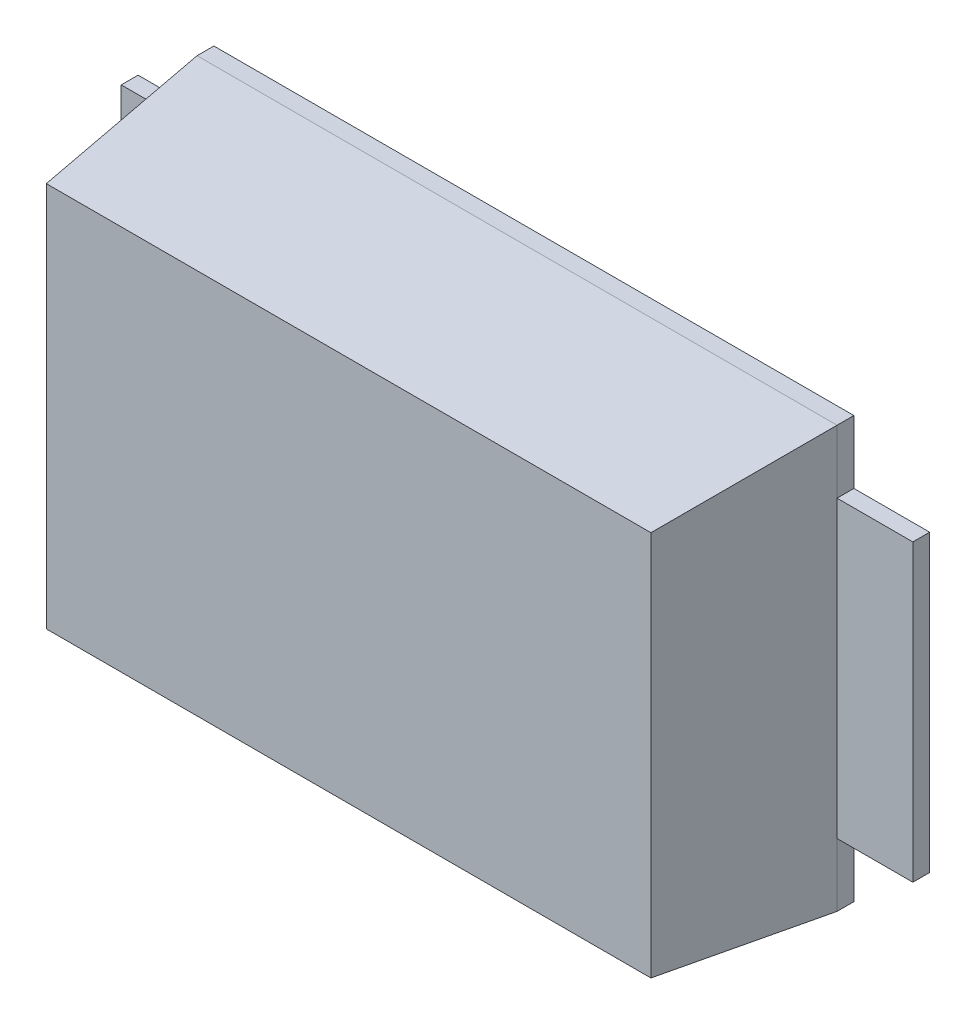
ISO-10303-21;
HEADER;
FILE_DESCRIPTION(('STEP AP214'),'2;1');
FILE_NAME('part.step','',(''),(''),'','','');
FILE_SCHEMA(('AUTOMOTIVE_DESIGN { 1 0 10303 214 1 1 1 1 }'));
ENDSEC;
DATA;
#1=APPLICATION_CONTEXT('core data for automotive mechanical design processes');
#2=APPLICATION_PROTOCOL_DEFINITION('international standard','automotive_design',2000,#1);
#3=PRODUCT_CONTEXT('',#1,'mechanical');
#4=PRODUCT('Part','Part','',(#3));
#5=PRODUCT_RELATED_PRODUCT_CATEGORY('part','',(#4));
#6=PRODUCT_DEFINITION_FORMATION('','',#4);
#7=PRODUCT_DEFINITION_CONTEXT('part definition',#1,'design');
#8=PRODUCT_DEFINITION('design','',#6,#7);
#9=PRODUCT_DEFINITION_SHAPE('','',#8);
#10=(LENGTH_UNIT() NAMED_UNIT(*) SI_UNIT(.MILLI.,.METRE.));
#11=(NAMED_UNIT(*) PLANE_ANGLE_UNIT() SI_UNIT($,.RADIAN.));
#12=(NAMED_UNIT(*) SI_UNIT($,.STERADIAN.) SOLID_ANGLE_UNIT());
#13=UNCERTAINTY_MEASURE_WITH_UNIT(LENGTH_MEASURE(1.E-05),#10,'distance_accuracy_value','');
#14=(GEOMETRIC_REPRESENTATION_CONTEXT(3) GLOBAL_UNCERTAINTY_ASSIGNED_CONTEXT((#13)) GLOBAL_UNIT_ASSIGNED_CONTEXT((#10,
#11,#12)) REPRESENTATION_CONTEXT('',''));
#15=CARTESIAN_POINT('',(0.,0.,0.));
#16=DIRECTION('',(0.,0.,1.));
#17=DIRECTION('',(1.,0.,0.));
#18=AXIS2_PLACEMENT_3D('',#15,#16,#17);
#19=CARTESIAN_POINT('',(0.,0.,1.1));
#20=DIRECTION('',(0.,0.,1.));
#21=DIRECTION('',(1.,0.,0.));
#22=AXIS2_PLACEMENT_3D('',#19,#20,#21);
#23=PLANE('',#22);
#24=DIRECTION('',(1.,0.,0.));
#25=VECTOR('',#24,1.);
#26=CARTESIAN_POINT('',(-0.95,1.144895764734,1.1));
#27=LINE('',#26,#25);
#28=CARTESIAN_POINT('',(-1.794895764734,1.144895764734,1.1));
#29=VERTEX_POINT('',#28);
#30=CARTESIAN_POINT('',(1.794895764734,1.144895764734,1.1));
#31=VERTEX_POINT('',#30);
#32=EDGE_CURVE('E43',#29,#31,#27,.T.);
#33=ORIENTED_EDGE('',*,*,#32,.F.);
#34=DIRECTION('',(0.,1.,0.));
#35=VECTOR('',#34,1.);
#36=CARTESIAN_POINT('',(-1.794895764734,-0.625,1.1));
#37=LINE('',#36,#35);
#38=CARTESIAN_POINT('',(-1.794895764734,-1.144895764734,1.1));
#39=VERTEX_POINT('',#38);
#40=EDGE_CURVE('E293',#39,#29,#37,.T.);
#41=ORIENTED_EDGE('',*,*,#40,.F.);
#42=DIRECTION('',(-1.,0.,0.));
#43=VECTOR('',#42,1.);
#44=CARTESIAN_POINT('',(0.95,-1.144895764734,1.1));
#45=LINE('',#44,#43);
#46=CARTESIAN_POINT('',(1.794895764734,-1.144895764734,1.1));
#47=VERTEX_POINT('',#46);
#48=EDGE_CURVE('E247',#47,#39,#45,.T.);
#49=ORIENTED_EDGE('',*,*,#48,.F.);
#50=DIRECTION('',(0.,-1.,0.));
#51=VECTOR('',#50,1.);
#52=CARTESIAN_POINT('',(1.794895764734,0.625,1.1));
#53=LINE('',#52,#51);
#54=EDGE_CURVE('E11',#31,#47,#53,.T.);
#55=ORIENTED_EDGE('',*,*,#54,.F.);
#56=EDGE_LOOP('',(#33,#41,#49,#55));
#57=FACE_BOUND('',#56,.T.);
#58=ADVANCED_FACE('F17',(#57),#23,.T.);
#59=CARTESIAN_POINT('',(1.9,1.25,0.1));
#60=DIRECTION('',(0.994521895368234,0.,0.104528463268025));
#61=DIRECTION('',(0.,-1.,0.));
#62=AXIS2_PLACEMENT_3D('',#59,#60,#61);
#63=PLANE('',#62);
#64=ORIENTED_EDGE('',*,*,#54,.T.);
#65=DIRECTION('',(-0.103962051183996,0.103962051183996,0.989132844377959));
#66=VECTOR('',#65,1.);
#67=CARTESIAN_POINT('',(1.886489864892,-1.236489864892,0.228540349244));
#68=LINE('',#67,#66);
#69=CARTESIAN_POINT('',(1.9,-1.25,0.1));
#70=VERTEX_POINT('',#69);
#71=EDGE_CURVE('E286',#70,#47,#68,.T.);
#72=ORIENTED_EDGE('',*,*,#71,.F.);
#73=DIRECTION('',(0.,1.,0.));
#74=VECTOR('',#73,1.);
#75=CARTESIAN_POINT('',(1.9,-1.25,0.1));
#76=LINE('',#75,#74);
#77=CARTESIAN_POINT('',(1.9,-0.875,0.1));
#78=VERTEX_POINT('',#77);
#79=EDGE_CURVE('E572',#70,#78,#76,.T.);
#80=ORIENTED_EDGE('',*,*,#79,.T.);
#81=DIRECTION('',(0.,1.,0.));
#82=VECTOR('',#81,1.);
#83=CARTESIAN_POINT('',(1.9,-1.25,0.1));
#84=LINE('',#83,#82);
#85=CARTESIAN_POINT('',(1.9,0.875,0.1));
#86=VERTEX_POINT('',#85);
#87=EDGE_CURVE('E189',#78,#86,#84,.T.);
#88=ORIENTED_EDGE('',*,*,#87,.T.);
#89=DIRECTION('',(0.,1.,0.));
#90=VECTOR('',#89,1.);
#91=CARTESIAN_POINT('',(1.9,-1.25,0.1));
#92=LINE('',#91,#90);
#93=CARTESIAN_POINT('',(1.9,1.25,0.1));
#94=VERTEX_POINT('',#93);
#95=EDGE_CURVE('E186',#86,#94,#92,.T.);
#96=ORIENTED_EDGE('',*,*,#95,.T.);
#97=DIRECTION('',(-0.103962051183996,-0.103962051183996,0.989132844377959));
#98=VECTOR('',#97,1.);
#99=CARTESIAN_POINT('',(1.879464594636,1.229464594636,0.295381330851));
#100=LINE('',#99,#98);
#101=EDGE_CURVE('E20',#94,#31,#100,.T.);
#102=ORIENTED_EDGE('',*,*,#101,.T.);
#103=EDGE_LOOP('',(#64,#72,#80,#88,#96,#102));
#104=FACE_BOUND('',#103,.T.);
#105=ADVANCED_FACE('F187',(#104),#63,.T.);
#106=CARTESIAN_POINT('',(-1.9,1.25,0.1));
#107=DIRECTION('',(0.,0.994521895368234,0.104528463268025));
#108=DIRECTION('',(1.,0.,0.));
#109=AXIS2_PLACEMENT_3D('',#106,#107,#108);
#110=PLANE('',#109);
#111=ORIENTED_EDGE('',*,*,#32,.T.);
#112=ORIENTED_EDGE('',*,*,#101,.F.);
#113=DIRECTION('',(-1.,0.,0.));
#114=VECTOR('',#113,1.);
#115=CARTESIAN_POINT('',(1.9,1.25,0.1));
#116=LINE('',#115,#114);
#117=CARTESIAN_POINT('',(-1.9,1.25,0.1));
#118=VERTEX_POINT('',#117);
#119=EDGE_CURVE('E167',#94,#118,#116,.T.);
#120=ORIENTED_EDGE('',*,*,#119,.T.);
#121=DIRECTION('',(0.103962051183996,-0.103962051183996,0.989132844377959));
#122=VECTOR('',#121,1.);
#123=CARTESIAN_POINT('',(-1.886489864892,1.236489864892,0.228540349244));
#124=LINE('',#123,#122);
#125=EDGE_CURVE('E294',#118,#29,#124,.T.);
#126=ORIENTED_EDGE('',*,*,#125,.T.);
#127=EDGE_LOOP('',(#111,#112,#120,#126));
#128=FACE_BOUND('',#127,.T.);
#129=ADVANCED_FACE('F166',(#128),#110,.T.);
#130=CARTESIAN_POINT('',(-1.9,-1.25,0.1));
#131=DIRECTION('',(-0.994521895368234,0.,0.104528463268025));
#132=DIRECTION('',(0.,1.,0.));
#133=AXIS2_PLACEMENT_3D('',#130,#131,#132);
#134=PLANE('',#133);
#135=ORIENTED_EDGE('',*,*,#40,.T.);
#136=ORIENTED_EDGE('',*,*,#125,.F.);
#137=DIRECTION('',(0.,-1.,0.));
#138=VECTOR('',#137,1.);
#139=CARTESIAN_POINT('',(-1.9,1.25,0.1));
#140=LINE('',#139,#138);
#141=CARTESIAN_POINT('',(-1.9,0.875,0.1));
#142=VERTEX_POINT('',#141);
#143=EDGE_CURVE('E266',#118,#142,#140,.T.);
#144=ORIENTED_EDGE('',*,*,#143,.T.);
#145=DIRECTION('',(0.,-1.,0.));
#146=VECTOR('',#145,1.);
#147=CARTESIAN_POINT('',(-1.9,1.25,0.1));
#148=LINE('',#147,#146);
#149=CARTESIAN_POINT('',(-1.9,-0.875,0.1));
#150=VERTEX_POINT('',#149);
#151=EDGE_CURVE('E262',#142,#150,#148,.T.);
#152=ORIENTED_EDGE('',*,*,#151,.T.);
#153=DIRECTION('',(0.,-1.,0.));
#154=VECTOR('',#153,1.);
#155=CARTESIAN_POINT('',(-1.9,1.25,0.1));
#156=LINE('',#155,#154);
#157=CARTESIAN_POINT('',(-1.9,-1.25,0.1));
#158=VERTEX_POINT('',#157);
#159=EDGE_CURVE('E276',#150,#158,#156,.T.);
#160=ORIENTED_EDGE('',*,*,#159,.T.);
#161=DIRECTION('',(0.103962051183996,0.103962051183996,0.989132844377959));
#162=VECTOR('',#161,1.);
#163=CARTESIAN_POINT('',(-1.879464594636,-1.229464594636,0.295381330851));
#164=LINE('',#163,#162);
#165=EDGE_CURVE('E251',#158,#39,#164,.T.);
#166=ORIENTED_EDGE('',*,*,#165,.T.);
#167=EDGE_LOOP('',(#135,#136,#144,#152,#160,#166));
#168=FACE_BOUND('',#167,.T.);
#169=ADVANCED_FACE('F333',(#168),#134,.T.);
#170=CARTESIAN_POINT('',(1.9,-1.25,0.1));
#171=DIRECTION('',(0.,-0.994521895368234,0.104528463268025));
#172=DIRECTION('',(-1.,0.,0.));
#173=AXIS2_PLACEMENT_3D('',#170,#171,#172);
#174=PLANE('',#173);
#175=ORIENTED_EDGE('',*,*,#48,.T.);
#176=ORIENTED_EDGE('',*,*,#165,.F.);
#177=DIRECTION('',(1.,0.,0.));
#178=VECTOR('',#177,1.);
#179=CARTESIAN_POINT('',(-1.9,-1.25,0.1));
#180=LINE('',#179,#178);
#181=EDGE_CURVE('E252',#158,#70,#180,.T.);
#182=ORIENTED_EDGE('',*,*,#181,.T.);
#183=ORIENTED_EDGE('',*,*,#71,.T.);
#184=EDGE_LOOP('',(#175,#176,#182,#183));
#185=FACE_BOUND('',#184,.T.);
#186=ADVANCED_FACE('F337',(#185),#174,.T.);
#187=CARTESIAN_POINT('',(0.,0.,0.0001));
#188=DIRECTION('',(0.,0.,1.));
#189=DIRECTION('',(1.,0.,0.));
#190=AXIS2_PLACEMENT_3D('',#187,#188,#189);
#191=PLANE('',#190);
#192=DIRECTION('',(1.,0.,0.));
#193=VECTOR('',#192,1.);
#194=CARTESIAN_POINT('',(0.,1.25,0.0001));
#195=LINE('',#194,#193);
#196=CARTESIAN_POINT('',(-1.9,1.25,0.0001));
#197=VERTEX_POINT('',#196);
#198=CARTESIAN_POINT('',(1.9,1.25,0.0001));
#199=VERTEX_POINT('',#198);
#200=EDGE_CURVE('E183',#197,#199,#195,.T.);
#201=ORIENTED_EDGE('',*,*,#200,.T.);
#202=DIRECTION('',(0.,-1.,0.));
#203=VECTOR('',#202,1.);
#204=CARTESIAN_POINT('',(1.9,0.,0.0001));
#205=LINE('',#204,#203);
#206=CARTESIAN_POINT('',(1.9,0.875,0.0001));
#207=VERTEX_POINT('',#206);
#208=EDGE_CURVE('E197',#199,#207,#205,.T.);
#209=ORIENTED_EDGE('',*,*,#208,.T.);
#210=DIRECTION('',(0.,-1.,0.));
#211=VECTOR('',#210,1.);
#212=CARTESIAN_POINT('',(1.9,0.,0.0001));
#213=LINE('',#212,#211);
#214=CARTESIAN_POINT('',(1.9,-0.875,0.0001));
#215=VERTEX_POINT('',#214);
#216=EDGE_CURVE('E617',#207,#215,#213,.T.);
#217=ORIENTED_EDGE('',*,*,#216,.T.);
#218=DIRECTION('',(0.,-1.,0.));
#219=VECTOR('',#218,1.);
#220=CARTESIAN_POINT('',(1.9,0.,0.0001));
#221=LINE('',#220,#219);
#222=CARTESIAN_POINT('',(1.9,-1.25,0.0001));
#223=VERTEX_POINT('',#222);
#224=EDGE_CURVE('E202',#215,#223,#221,.T.);
#225=ORIENTED_EDGE('',*,*,#224,.T.);
#226=DIRECTION('',(-1.,0.,0.));
#227=VECTOR('',#226,1.);
#228=CARTESIAN_POINT('',(0.,-1.25,0.0001));
#229=LINE('',#228,#227);
#230=CARTESIAN_POINT('',(-1.9,-1.25,0.0001));
#231=VERTEX_POINT('',#230);
#232=EDGE_CURVE('E182',#223,#231,#229,.T.);
#233=ORIENTED_EDGE('',*,*,#232,.T.);
#234=DIRECTION('',(0.,1.,0.));
#235=VECTOR('',#234,1.);
#236=CARTESIAN_POINT('',(-1.9,0.,0.0001));
#237=LINE('',#236,#235);
#238=CARTESIAN_POINT('',(-1.9,-0.875,0.0001));
#239=VERTEX_POINT('',#238);
#240=EDGE_CURVE('E275',#231,#239,#237,.T.);
#241=ORIENTED_EDGE('',*,*,#240,.T.);
#242=DIRECTION('',(0.,1.,0.));
#243=VECTOR('',#242,1.);
#244=CARTESIAN_POINT('',(-1.9,0.,0.0001));
#245=LINE('',#244,#243);
#246=CARTESIAN_POINT('',(-1.9,0.875,0.0001));
#247=VERTEX_POINT('',#246);
#248=EDGE_CURVE('E222',#239,#247,#245,.T.);
#249=ORIENTED_EDGE('',*,*,#248,.T.);
#250=DIRECTION('',(0.,1.,0.));
#251=VECTOR('',#250,1.);
#252=CARTESIAN_POINT('',(-1.9,0.,0.0001));
#253=LINE('',#252,#251);
#254=EDGE_CURVE('E271',#247,#197,#253,.T.);
#255=ORIENTED_EDGE('',*,*,#254,.T.);
#256=EDGE_LOOP('',(#201,#209,#217,#225,#233,#241,#249,#255));
#257=FACE_BOUND('',#256,.T.);
#258=ADVANCED_FACE('F450',(#257),#191,.F.);
#259=CARTESIAN_POINT('',(0.,-1.25,0.1));
#260=DIRECTION('',(0.,-1.,0.));
#261=DIRECTION('',(0.,0.,-1.));
#262=AXIS2_PLACEMENT_3D('',#259,#260,#261);
#263=PLANE('',#262);
#264=ORIENTED_EDGE('',*,*,#232,.F.);
#265=DIRECTION('',(0.,0.,-1.));
#266=VECTOR('',#265,1.);
#267=CARTESIAN_POINT('',(1.9,-1.25,0.1));
#268=LINE('',#267,#266);
#269=EDGE_CURVE('E575',#70,#223,#268,.T.);
#270=ORIENTED_EDGE('',*,*,#269,.F.);
#271=ORIENTED_EDGE('',*,*,#181,.F.);
#272=DIRECTION('',(0.,0.,-1.));
#273=VECTOR('',#272,1.);
#274=CARTESIAN_POINT('',(-1.9,-1.25,0.1));
#275=LINE('',#274,#273);
#276=EDGE_CURVE('E280',#158,#231,#275,.T.);
#277=ORIENTED_EDGE('',*,*,#276,.T.);
#278=EDGE_LOOP('',(#264,#270,#271,#277));
#279=FACE_BOUND('',#278,.T.);
#280=ADVANCED_FACE('F443',(#279),#263,.T.);
#281=CARTESIAN_POINT('',(0.,1.25,0.1));
#282=DIRECTION('',(0.,1.,0.));
#283=DIRECTION('',(1.,0.,0.));
#284=AXIS2_PLACEMENT_3D('',#281,#282,#283);
#285=PLANE('',#284);
#286=ORIENTED_EDGE('',*,*,#200,.F.);
#287=DIRECTION('',(0.,0.,-1.));
#288=VECTOR('',#287,1.);
#289=CARTESIAN_POINT('',(-1.9,1.25,0.1));
#290=LINE('',#289,#288);
#291=EDGE_CURVE('E179',#118,#197,#290,.T.);
#292=ORIENTED_EDGE('',*,*,#291,.F.);
#293=ORIENTED_EDGE('',*,*,#119,.F.);
#294=DIRECTION('',(0.,0.,-1.));
#295=VECTOR('',#294,1.);
#296=CARTESIAN_POINT('',(1.9,1.25,0.1));
#297=LINE('',#296,#295);
#298=EDGE_CURVE('E176',#94,#199,#297,.T.);
#299=ORIENTED_EDGE('',*,*,#298,.T.);
#300=EDGE_LOOP('',(#286,#292,#293,#299));
#301=FACE_BOUND('',#300,.T.);
#302=ADVANCED_FACE('F174',(#301),#285,.T.);
#303=CARTESIAN_POINT('',(-1.9,0.,0.1));
#304=DIRECTION('',(-1.,0.,0.));
#305=DIRECTION('',(0.,0.,1.));
#306=AXIS2_PLACEMENT_3D('',#303,#304,#305);
#307=PLANE('',#306);
#308=DIRECTION('',(0.,0.,-1.));
#309=VECTOR('',#308,1.);
#310=CARTESIAN_POINT('',(-1.9,-0.875,0.05));
#311=LINE('',#310,#309);
#312=EDGE_CURVE('E246',#150,#239,#311,.T.);
#313=ORIENTED_EDGE('',*,*,#312,.T.);
#314=ORIENTED_EDGE('',*,*,#240,.F.);
#315=ORIENTED_EDGE('',*,*,#276,.F.);
#316=ORIENTED_EDGE('',*,*,#159,.F.);
#317=EDGE_LOOP('',(#313,#314,#315,#316));
#318=FACE_BOUND('',#317,.T.);
#319=ADVANCED_FACE('F428',(#318),#307,.T.);
#320=CARTESIAN_POINT('',(-1.9,0.,0.1));
#321=DIRECTION('',(-1.,0.,0.));
#322=DIRECTION('',(0.,0.,1.));
#323=AXIS2_PLACEMENT_3D('',#320,#321,#322);
#324=PLANE('',#323);
#325=DIRECTION('',(0.,0.,1.));
#326=VECTOR('',#325,1.);
#327=CARTESIAN_POINT('',(-1.9,0.875,0.05));
#328=LINE('',#327,#326);
#329=EDGE_CURVE('E209',#247,#142,#328,.T.);
#330=ORIENTED_EDGE('',*,*,#329,.T.);
#331=ORIENTED_EDGE('',*,*,#143,.F.);
#332=ORIENTED_EDGE('',*,*,#291,.T.);
#333=ORIENTED_EDGE('',*,*,#254,.F.);
#334=EDGE_LOOP('',(#330,#331,#332,#333));
#335=FACE_BOUND('',#334,.T.);
#336=ADVANCED_FACE('F309',(#335),#324,.T.);
#337=CARTESIAN_POINT('',(0.,0.,0.1));
#338=DIRECTION('',(0.,0.,1.));
#339=DIRECTION('',(1.,0.,0.));
#340=AXIS2_PLACEMENT_3D('',#337,#338,#339);
#341=PLANE('',#340);
#342=DIRECTION('',(-1.,0.,0.));
#343=VECTOR('',#342,1.);
#344=CARTESIAN_POINT('',(-1.0625,-0.875,0.1));
#345=LINE('',#344,#343);
#346=CARTESIAN_POINT('',(-2.35,-0.875,0.1));
#347=VERTEX_POINT('',#346);
#348=EDGE_CURVE('E234',#150,#347,#345,.T.);
#349=ORIENTED_EDGE('',*,*,#348,.F.);
#350=ORIENTED_EDGE('',*,*,#151,.F.);
#351=DIRECTION('',(1.,0.,0.));
#352=VECTOR('',#351,1.);
#353=CARTESIAN_POINT('',(-1.0625,0.875,0.1));
#354=LINE('',#353,#352);
#355=CARTESIAN_POINT('',(-2.35,0.875,0.1));
#356=VERTEX_POINT('',#355);
#357=EDGE_CURVE('E194',#356,#142,#354,.T.);
#358=ORIENTED_EDGE('',*,*,#357,.F.);
#359=DIRECTION('',(0.,1.,0.));
#360=VECTOR('',#359,1.);
#361=CARTESIAN_POINT('',(-2.35,0.,0.1));
#362=LINE('',#361,#360);
#363=EDGE_CURVE('E256',#347,#356,#362,.T.);
#364=ORIENTED_EDGE('',*,*,#363,.F.);
#365=EDGE_LOOP('',(#349,#350,#358,#364));
#366=FACE_BOUND('',#365,.T.);
#367=ADVANCED_FACE('F303',(#366),#341,.T.);
#368=CARTESIAN_POINT('',(-2.125,0.,0.));
#369=DIRECTION('',(0.,0.,1.));
#370=DIRECTION('',(1.,0.,0.));
#371=AXIS2_PLACEMENT_3D('',#368,#369,#370);
#372=PLANE('',#371);
#373=DIRECTION('',(0.,-1.,0.));
#374=VECTOR('',#373,1.);
#375=CARTESIAN_POINT('',(-1.9,0.875,0.));
#376=LINE('',#375,#374);
#377=CARTESIAN_POINT('',(-1.9,0.875,0.));
#378=VERTEX_POINT('',#377);
#379=CARTESIAN_POINT('',(-1.9,-0.875,0.));
#380=VERTEX_POINT('',#379);
#381=EDGE_CURVE('E230',#378,#380,#376,.T.);
#382=ORIENTED_EDGE('',*,*,#381,.T.);
#383=DIRECTION('',(-1.,0.,0.));
#384=VECTOR('',#383,1.);
#385=CARTESIAN_POINT('',(-1.9,-0.875,0.));
#386=LINE('',#385,#384);
#387=CARTESIAN_POINT('',(-2.35,-0.875,0.));
#388=VERTEX_POINT('',#387);
#389=EDGE_CURVE('E242',#380,#388,#386,.T.);
#390=ORIENTED_EDGE('',*,*,#389,.T.);
#391=DIRECTION('',(0.,1.,0.));
#392=VECTOR('',#391,1.);
#393=CARTESIAN_POINT('',(-2.35,-0.875,0.));
#394=LINE('',#393,#392);
#395=CARTESIAN_POINT('',(-2.35,0.875,0.));
#396=VERTEX_POINT('',#395);
#397=EDGE_CURVE('E258',#388,#396,#394,.T.);
#398=ORIENTED_EDGE('',*,*,#397,.T.);
#399=DIRECTION('',(1.,0.,0.));
#400=VECTOR('',#399,1.);
#401=CARTESIAN_POINT('',(-2.35,0.875,0.));
#402=LINE('',#401,#400);
#403=EDGE_CURVE('E217',#396,#378,#402,.T.);
#404=ORIENTED_EDGE('',*,*,#403,.T.);
#405=EDGE_LOOP('',(#382,#390,#398,#404));
#406=FACE_BOUND('',#405,.T.);
#407=ADVANCED_FACE('F308',(#406),#372,.F.);
#408=CARTESIAN_POINT('',(-2.35,0.,0.));
#409=DIRECTION('',(-1.,0.,0.));
#410=DIRECTION('',(0.,0.,1.));
#411=AXIS2_PLACEMENT_3D('',#408,#409,#410);
#412=PLANE('',#411);
#413=ORIENTED_EDGE('',*,*,#363,.T.);
#414=DIRECTION('',(0.,0.,1.));
#415=VECTOR('',#414,1.);
#416=CARTESIAN_POINT('',(-2.35,0.875,0.));
#417=LINE('',#416,#415);
#418=EDGE_CURVE('E218',#396,#356,#417,.T.);
#419=ORIENTED_EDGE('',*,*,#418,.F.);
#420=ORIENTED_EDGE('',*,*,#397,.F.);
#421=DIRECTION('',(0.,0.,1.));
#422=VECTOR('',#421,1.);
#423=CARTESIAN_POINT('',(-2.35,-0.875,0.));
#424=LINE('',#423,#422);
#425=EDGE_CURVE('E238',#388,#347,#424,.T.);
#426=ORIENTED_EDGE('',*,*,#425,.T.);
#427=EDGE_LOOP('',(#413,#419,#420,#426));
#428=FACE_BOUND('',#427,.T.);
#429=ADVANCED_FACE('F363',(#428),#412,.T.);
#430=CARTESIAN_POINT('',(-2.125,-0.875,0.));
#431=DIRECTION('',(0.,-1.,0.));
#432=DIRECTION('',(0.,0.,-1.));
#433=AXIS2_PLACEMENT_3D('',#430,#431,#432);
#434=PLANE('',#433);
#435=ORIENTED_EDGE('',*,*,#348,.T.);
#436=ORIENTED_EDGE('',*,*,#425,.F.);
#437=ORIENTED_EDGE('',*,*,#389,.F.);
#438=DIRECTION('',(0.,0.,1.));
#439=VECTOR('',#438,1.);
#440=CARTESIAN_POINT('',(-1.9,-0.875,0.));
#441=LINE('',#440,#439);
#442=EDGE_CURVE('E226',#380,#239,#441,.T.);
#443=ORIENTED_EDGE('',*,*,#442,.T.);
#444=ORIENTED_EDGE('',*,*,#312,.F.);
#445=EDGE_LOOP('',(#435,#436,#437,#443,#444));
#446=FACE_BOUND('',#445,.T.);
#447=ADVANCED_FACE('F358',(#446),#434,.T.);
#448=CARTESIAN_POINT('',(-1.9,0.,0.));
#449=DIRECTION('',(1.,0.,0.));
#450=DIRECTION('',(0.,1.,0.));
#451=AXIS2_PLACEMENT_3D('',#448,#449,#450);
#452=PLANE('',#451);
#453=ORIENTED_EDGE('',*,*,#248,.F.);
#454=ORIENTED_EDGE('',*,*,#442,.F.);
#455=ORIENTED_EDGE('',*,*,#381,.F.);
#456=DIRECTION('',(0.,0.,1.));
#457=VECTOR('',#456,1.);
#458=CARTESIAN_POINT('',(-1.9,0.875,0.));
#459=LINE('',#458,#457);
#460=EDGE_CURVE('E213',#378,#247,#459,.T.);
#461=ORIENTED_EDGE('',*,*,#460,.T.);
#462=EDGE_LOOP('',(#453,#454,#455,#461));
#463=FACE_BOUND('',#462,.T.);
#464=ADVANCED_FACE('F362',(#463),#452,.T.);
#465=CARTESIAN_POINT('',(-2.125,0.875,0.));
#466=DIRECTION('',(0.,1.,0.));
#467=DIRECTION('',(1.,0.,0.));
#468=AXIS2_PLACEMENT_3D('',#465,#466,#467);
#469=PLANE('',#468);
#470=ORIENTED_EDGE('',*,*,#357,.T.);
#471=ORIENTED_EDGE('',*,*,#329,.F.);
#472=ORIENTED_EDGE('',*,*,#460,.F.);
#473=ORIENTED_EDGE('',*,*,#403,.F.);
#474=ORIENTED_EDGE('',*,*,#418,.T.);
#475=EDGE_LOOP('',(#470,#471,#472,#473,#474));
#476=FACE_BOUND('',#475,.T.);
#477=ADVANCED_FACE('F393',(#476),#469,.T.);
#478=CARTESIAN_POINT('',(1.9,0.,0.1));
#479=DIRECTION('',(1.,0.,0.));
#480=DIRECTION('',(0.,1.,0.));
#481=AXIS2_PLACEMENT_3D('',#478,#479,#480);
#482=PLANE('',#481);
#483=DIRECTION('',(0.,0.,-1.));
#484=VECTOR('',#483,1.);
#485=CARTESIAN_POINT('',(1.9,0.875,0.05));
#486=LINE('',#485,#484);
#487=EDGE_CURVE('E563',#86,#207,#486,.T.);
#488=ORIENTED_EDGE('',*,*,#487,.T.);
#489=ORIENTED_EDGE('',*,*,#208,.F.);
#490=ORIENTED_EDGE('',*,*,#298,.F.);
#491=ORIENTED_EDGE('',*,*,#95,.F.);
#492=EDGE_LOOP('',(#488,#489,#490,#491));
#493=FACE_BOUND('',#492,.T.);
#494=ADVANCED_FACE('F196',(#493),#482,.T.);
#495=CARTESIAN_POINT('',(1.9,0.,0.1));
#496=DIRECTION('',(1.,0.,0.));
#497=DIRECTION('',(0.,1.,0.));
#498=AXIS2_PLACEMENT_3D('',#495,#496,#497);
#499=PLANE('',#498);
#500=DIRECTION('',(0.,0.,1.));
#501=VECTOR('',#500,1.);
#502=CARTESIAN_POINT('',(1.9,-0.875,0.05));
#503=LINE('',#502,#501);
#504=EDGE_CURVE('E602',#215,#78,#503,.T.);
#505=ORIENTED_EDGE('',*,*,#504,.T.);
#506=ORIENTED_EDGE('',*,*,#79,.F.);
#507=ORIENTED_EDGE('',*,*,#269,.T.);
#508=ORIENTED_EDGE('',*,*,#224,.F.);
#509=EDGE_LOOP('',(#505,#506,#507,#508));
#510=FACE_BOUND('',#509,.T.);
#511=ADVANCED_FACE('F324',(#510),#499,.T.);
#512=CARTESIAN_POINT('',(0.,0.,0.1));
#513=DIRECTION('',(0.,0.,1.));
#514=DIRECTION('',(1.,0.,0.));
#515=AXIS2_PLACEMENT_3D('',#512,#513,#514);
#516=PLANE('',#515);
#517=DIRECTION('',(1.,0.,0.));
#518=VECTOR('',#517,1.);
#519=CARTESIAN_POINT('',(1.0625,0.875,0.1));
#520=LINE('',#519,#518);
#521=CARTESIAN_POINT('',(2.35,0.875,0.1));
#522=VERTEX_POINT('',#521);
#523=EDGE_CURVE('E554',#86,#522,#520,.T.);
#524=ORIENTED_EDGE('',*,*,#523,.F.);
#525=ORIENTED_EDGE('',*,*,#87,.F.);
#526=DIRECTION('',(-1.,0.,0.));
#527=VECTOR('',#526,1.);
#528=CARTESIAN_POINT('',(1.0625,-0.875,0.1));
#529=LINE('',#528,#527);
#530=CARTESIAN_POINT('',(2.35,-0.875,0.1));
#531=VERTEX_POINT('',#530);
#532=EDGE_CURVE('E606',#531,#78,#529,.T.);
#533=ORIENTED_EDGE('',*,*,#532,.F.);
#534=DIRECTION('',(0.,-1.,0.));
#535=VECTOR('',#534,1.);
#536=CARTESIAN_POINT('',(2.35,0.,0.1));
#537=LINE('',#536,#535);
#538=EDGE_CURVE('E559',#522,#531,#537,.T.);
#539=ORIENTED_EDGE('',*,*,#538,.F.);
#540=EDGE_LOOP('',(#524,#525,#533,#539));
#541=FACE_BOUND('',#540,.T.);
#542=ADVANCED_FACE('F328',(#541),#516,.T.);
#543=CARTESIAN_POINT('',(2.125,0.,0.));
#544=DIRECTION('',(0.,0.,1.));
#545=DIRECTION('',(1.,0.,0.));
#546=AXIS2_PLACEMENT_3D('',#543,#544,#545);
#547=PLANE('',#546);
#548=DIRECTION('',(0.,-1.,0.));
#549=VECTOR('',#548,1.);
#550=CARTESIAN_POINT('',(1.9,0.875,0.));
#551=LINE('',#550,#549);
#552=CARTESIAN_POINT('',(1.9,0.875,0.));
#553=VERTEX_POINT('',#552);
#554=CARTESIAN_POINT('',(1.9,-0.875,0.));
#555=VERTEX_POINT('',#554);
#556=EDGE_CURVE('E558',#553,#555,#551,.T.);
#557=ORIENTED_EDGE('',*,*,#556,.F.);
#558=DIRECTION('',(-1.,0.,0.));
#559=VECTOR('',#558,1.);
#560=CARTESIAN_POINT('',(2.35,0.875,0.));
#561=LINE('',#560,#559);
#562=CARTESIAN_POINT('',(2.35,0.875,0.));
#563=VERTEX_POINT('',#562);
#564=EDGE_CURVE('E567',#563,#553,#561,.T.);
#565=ORIENTED_EDGE('',*,*,#564,.F.);
#566=DIRECTION('',(0.,1.,0.));
#567=VECTOR('',#566,1.);
#568=CARTESIAN_POINT('',(2.35,-0.875,0.));
#569=LINE('',#568,#567);
#570=CARTESIAN_POINT('',(2.35,-0.875,0.));
#571=VERTEX_POINT('',#570);
#572=EDGE_CURVE('E562',#571,#563,#569,.T.);
#573=ORIENTED_EDGE('',*,*,#572,.F.);
#574=DIRECTION('',(1.,0.,0.));
#575=VECTOR('',#574,1.);
#576=CARTESIAN_POINT('',(1.9,-0.875,0.));
#577=LINE('',#576,#575);
#578=EDGE_CURVE('E607',#555,#571,#577,.T.);
#579=ORIENTED_EDGE('',*,*,#578,.F.);
#580=EDGE_LOOP('',(#557,#565,#573,#579));
#581=FACE_BOUND('',#580,.T.);
#582=ADVANCED_FACE('F353',(#581),#547,.F.);
#583=CARTESIAN_POINT('',(2.35,0.,0.));
#584=DIRECTION('',(1.,0.,0.));
#585=DIRECTION('',(0.,1.,0.));
#586=AXIS2_PLACEMENT_3D('',#583,#584,#585);
#587=PLANE('',#586);
#588=ORIENTED_EDGE('',*,*,#538,.T.);
#589=DIRECTION('',(0.,0.,1.));
#590=VECTOR('',#589,1.);
#591=CARTESIAN_POINT('',(2.35,-0.875,0.));
#592=LINE('',#591,#590);
#593=EDGE_CURVE('E611',#571,#531,#592,.T.);
#594=ORIENTED_EDGE('',*,*,#593,.F.);
#595=ORIENTED_EDGE('',*,*,#572,.T.);
#596=DIRECTION('',(0.,0.,1.));
#597=VECTOR('',#596,1.);
#598=CARTESIAN_POINT('',(2.35,0.875,0.));
#599=LINE('',#598,#597);
#600=EDGE_CURVE('E557',#563,#522,#599,.T.);
#601=ORIENTED_EDGE('',*,*,#600,.T.);
#602=EDGE_LOOP('',(#588,#594,#595,#601));
#603=FACE_BOUND('',#602,.T.);
#604=ADVANCED_FACE('F371',(#603),#587,.T.);
#605=CARTESIAN_POINT('',(2.125,0.875,0.));
#606=DIRECTION('',(0.,1.,0.));
#607=DIRECTION('',(1.,0.,0.));
#608=AXIS2_PLACEMENT_3D('',#605,#606,#607);
#609=PLANE('',#608);
#610=ORIENTED_EDGE('',*,*,#523,.T.);
#611=ORIENTED_EDGE('',*,*,#600,.F.);
#612=ORIENTED_EDGE('',*,*,#564,.T.);
#613=DIRECTION('',(0.,0.,1.));
#614=VECTOR('',#613,1.);
#615=CARTESIAN_POINT('',(1.9,0.875,0.));
#616=LINE('',#615,#614);
#617=EDGE_CURVE('E553',#553,#207,#616,.T.);
#618=ORIENTED_EDGE('',*,*,#617,.T.);
#619=ORIENTED_EDGE('',*,*,#487,.F.);
#620=EDGE_LOOP('',(#610,#611,#612,#618,#619));
#621=FACE_BOUND('',#620,.T.);
#622=ADVANCED_FACE('F345',(#621),#609,.T.);
#623=CARTESIAN_POINT('',(1.9,0.,0.));
#624=DIRECTION('',(-1.,0.,0.));
#625=DIRECTION('',(0.,0.,1.));
#626=AXIS2_PLACEMENT_3D('',#623,#624,#625);
#627=PLANE('',#626);
#628=ORIENTED_EDGE('',*,*,#216,.F.);
#629=ORIENTED_EDGE('',*,*,#617,.F.);
#630=ORIENTED_EDGE('',*,*,#556,.T.);
#631=DIRECTION('',(0.,0.,1.));
#632=VECTOR('',#631,1.);
#633=CARTESIAN_POINT('',(1.9,-0.875,0.));
#634=LINE('',#633,#632);
#635=EDGE_CURVE('E605',#555,#215,#634,.T.);
#636=ORIENTED_EDGE('',*,*,#635,.T.);
#637=EDGE_LOOP('',(#628,#629,#630,#636));
#638=FACE_BOUND('',#637,.T.);
#639=ADVANCED_FACE('F319',(#638),#627,.T.);
#640=CARTESIAN_POINT('',(2.125,-0.875,0.));
#641=DIRECTION('',(0.,-1.,0.));
#642=DIRECTION('',(0.,0.,-1.));
#643=AXIS2_PLACEMENT_3D('',#640,#641,#642);
#644=PLANE('',#643);
#645=ORIENTED_EDGE('',*,*,#532,.T.);
#646=ORIENTED_EDGE('',*,*,#504,.F.);
#647=ORIENTED_EDGE('',*,*,#635,.F.);
#648=ORIENTED_EDGE('',*,*,#578,.T.);
#649=ORIENTED_EDGE('',*,*,#593,.T.);
#650=EDGE_LOOP('',(#645,#646,#647,#648,#649));
#651=FACE_BOUND('',#650,.T.);
#652=ADVANCED_FACE('F315',(#651),#644,.T.);
#653=CLOSED_SHELL('',(#58,#105,#129,#169,#186,#258,#280,#302,#319,#336,#367,#407,#429,#447,#464,
#477,#494,#511,#542,#582,#604,#622,#639,#652));
#654=MANIFOLD_SOLID_BREP('B1',#653);
#655=ADVANCED_BREP_SHAPE_REPRESENTATION('',(#18,#654),#14);
#656=SHAPE_DEFINITION_REPRESENTATION(#9,#655);
ENDSEC;
END-ISO-10303-21;
